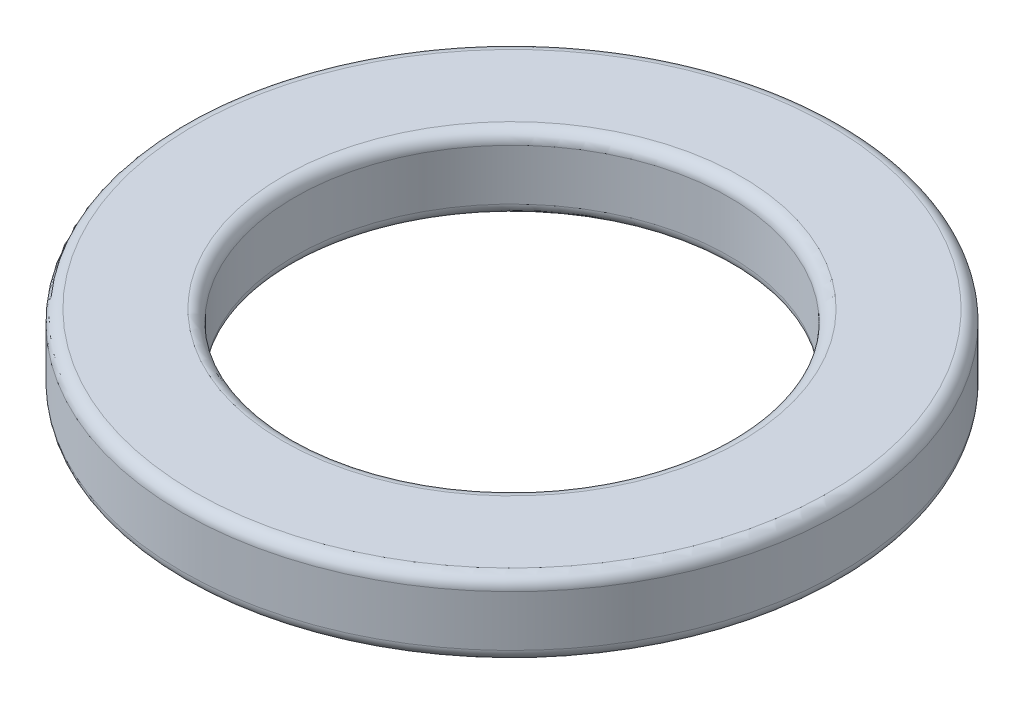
ISO-10303-21;
HEADER;
FILE_DESCRIPTION(('STEP AP214'),'2;1');
FILE_NAME('part.step','',(''),(''),'','','');
FILE_SCHEMA(('AUTOMOTIVE_DESIGN { 1 0 10303 214 1 1 1 1 }'));
ENDSEC;
DATA;
#1=APPLICATION_CONTEXT('core data for automotive mechanical design processes');
#2=APPLICATION_PROTOCOL_DEFINITION('international standard','automotive_design',2000,#1);
#3=PRODUCT_CONTEXT('',#1,'mechanical');
#4=PRODUCT('Part','Part','',(#3));
#5=PRODUCT_RELATED_PRODUCT_CATEGORY('part','',(#4));
#6=PRODUCT_DEFINITION_FORMATION('','',#4);
#7=PRODUCT_DEFINITION_CONTEXT('part definition',#1,'design');
#8=PRODUCT_DEFINITION('design','',#6,#7);
#9=PRODUCT_DEFINITION_SHAPE('','',#8);
#10=(LENGTH_UNIT() NAMED_UNIT(*) SI_UNIT(.MILLI.,.METRE.));
#11=(NAMED_UNIT(*) PLANE_ANGLE_UNIT() SI_UNIT($,.RADIAN.));
#12=(NAMED_UNIT(*) SI_UNIT($,.STERADIAN.) SOLID_ANGLE_UNIT());
#13=UNCERTAINTY_MEASURE_WITH_UNIT(LENGTH_MEASURE(1.E-05),#10,'distance_accuracy_value','');
#14=(GEOMETRIC_REPRESENTATION_CONTEXT(3) GLOBAL_UNCERTAINTY_ASSIGNED_CONTEXT((#13)) GLOBAL_UNIT_ASSIGNED_CONTEXT((#10,
#11,#12)) REPRESENTATION_CONTEXT('',''));
#15=CARTESIAN_POINT('',(0.,0.,0.));
#16=DIRECTION('',(0.,0.,1.));
#17=DIRECTION('',(1.,0.,0.));
#18=AXIS2_PLACEMENT_3D('',#15,#16,#17);
#19=CARTESIAN_POINT('',(0.,2.1,0.));
#20=DIRECTION('',(0.,1.,0.));
#21=DIRECTION('',(0.,0.,1.));
#22=AXIS2_PLACEMENT_3D('',#19,#20,#21);
#23=TOROIDAL_SURFACE('',#22,7.65,0.4);
#24=CARTESIAN_POINT('',(0.,2.1,0.));
#25=DIRECTION('',(0.,1.,0.));
#26=DIRECTION('',(0.,0.,1.));
#27=AXIS2_PLACEMENT_3D('',#24,#25,#26);
#28=CIRCLE('',#27,7.25);
#29=CARTESIAN_POINT('',(0.,2.1,7.25));
#30=VERTEX_POINT('',#29);
#31=EDGE_CURVE('E10',#30,#30,#28,.T.);
#32=ORIENTED_EDGE('',*,*,#31,.F.);
#33=EDGE_LOOP('',(#32));
#34=FACE_BOUND('',#33,.T.);
#35=CARTESIAN_POINT('',(0.,2.5,0.));
#36=DIRECTION('',(0.,1.,0.));
#37=DIRECTION('',(0.,0.,1.));
#38=AXIS2_PLACEMENT_3D('',#35,#36,#37);
#39=CIRCLE('',#38,7.65);
#40=CARTESIAN_POINT('',(0.,2.5,7.65));
#41=VERTEX_POINT('',#40);
#42=EDGE_CURVE('E57',#41,#41,#39,.T.);
#43=ORIENTED_EDGE('',*,*,#42,.T.);
#44=EDGE_LOOP('',(#43));
#45=FACE_BOUND('',#44,.T.);
#46=ADVANCED_FACE('F29',(#34,#45),#23,.T.);
#47=CARTESIAN_POINT('',(0.,15.7889265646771,0.));
#48=DIRECTION('',(0.,1.,0.));
#49=DIRECTION('',(0.,0.,1.));
#50=AXIS2_PLACEMENT_3D('',#47,#48,#49);
#51=CYLINDRICAL_SURFACE('',#50,7.25);
#52=CARTESIAN_POINT('',(0.,0.400000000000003,0.));
#53=DIRECTION('',(0.,1.,0.));
#54=DIRECTION('',(0.,0.,1.));
#55=AXIS2_PLACEMENT_3D('',#52,#53,#54);
#56=CIRCLE('',#55,7.25);
#57=CARTESIAN_POINT('',(0.,0.400000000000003,7.25));
#58=VERTEX_POINT('',#57);
#59=EDGE_CURVE('E35',#58,#58,#56,.T.);
#60=ORIENTED_EDGE('',*,*,#59,.F.);
#61=EDGE_LOOP('',(#60));
#62=FACE_BOUND('',#61,.T.);
#63=ORIENTED_EDGE('',*,*,#31,.T.);
#64=EDGE_LOOP('',(#63));
#65=FACE_BOUND('',#64,.T.);
#66=ADVANCED_FACE('F94',(#62,#65),#51,.F.);
#67=CARTESIAN_POINT('',(0.,0.399999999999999,0.));
#68=DIRECTION('',(0.,1.,0.));
#69=DIRECTION('',(0.,0.,1.));
#70=AXIS2_PLACEMENT_3D('',#67,#68,#69);
#71=TOROIDAL_SURFACE('',#70,7.65,0.4);
#72=CARTESIAN_POINT('',(0.,0.,0.));
#73=DIRECTION('',(0.,1.,0.));
#74=DIRECTION('',(0.,0.,1.));
#75=AXIS2_PLACEMENT_3D('',#72,#73,#74);
#76=CIRCLE('',#75,7.65);
#77=CARTESIAN_POINT('',(0.,0.,7.65));
#78=VERTEX_POINT('',#77);
#79=EDGE_CURVE('E39',#78,#78,#76,.T.);
#80=ORIENTED_EDGE('',*,*,#79,.F.);
#81=EDGE_LOOP('',(#80));
#82=FACE_BOUND('',#81,.T.);
#83=ORIENTED_EDGE('',*,*,#59,.T.);
#84=EDGE_LOOP('',(#83));
#85=FACE_BOUND('',#84,.T.);
#86=ADVANCED_FACE('F89',(#82,#85),#71,.T.);
#87=CARTESIAN_POINT('',(7.65,0.,0.));
#88=DIRECTION('',(0.,1.,0.));
#89=DIRECTION('',(0.,0.,1.));
#90=AXIS2_PLACEMENT_3D('',#87,#88,#89);
#91=PLANE('',#90);
#92=CARTESIAN_POINT('',(0.,0.,0.));
#93=DIRECTION('',(0.,1.,0.));
#94=DIRECTION('',(0.,0.,1.));
#95=AXIS2_PLACEMENT_3D('',#92,#93,#94);
#96=CIRCLE('',#95,10.6);
#97=CARTESIAN_POINT('',(0.,0.,10.6));
#98=VERTEX_POINT('',#97);
#99=EDGE_CURVE('E43',#98,#98,#96,.T.);
#100=ORIENTED_EDGE('',*,*,#99,.F.);
#101=EDGE_LOOP('',(#100));
#102=FACE_BOUND('',#101,.T.);
#103=ORIENTED_EDGE('',*,*,#79,.T.);
#104=EDGE_LOOP('',(#103));
#105=FACE_BOUND('',#104,.T.);
#106=ADVANCED_FACE('F83',(#102,#105),#91,.F.);
#107=CARTESIAN_POINT('',(0.,0.399999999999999,0.));
#108=DIRECTION('',(0.,1.,0.));
#109=DIRECTION('',(0.,0.,1.));
#110=AXIS2_PLACEMENT_3D('',#107,#108,#109);
#111=TOROIDAL_SURFACE('',#110,10.6,0.4);
#112=CARTESIAN_POINT('',(0.,0.400000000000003,0.));
#113=DIRECTION('',(0.,1.,0.));
#114=DIRECTION('',(0.,0.,1.));
#115=AXIS2_PLACEMENT_3D('',#112,#113,#114);
#116=CIRCLE('',#115,11.);
#117=CARTESIAN_POINT('',(0.,0.400000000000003,11.));
#118=VERTEX_POINT('',#117);
#119=EDGE_CURVE('E48',#118,#118,#116,.T.);
#120=ORIENTED_EDGE('',*,*,#119,.F.);
#121=EDGE_LOOP('',(#120));
#122=FACE_BOUND('',#121,.T.);
#123=ORIENTED_EDGE('',*,*,#99,.T.);
#124=EDGE_LOOP('',(#123));
#125=FACE_BOUND('',#124,.T.);
#126=ADVANCED_FACE('F77',(#122,#125),#111,.T.);
#127=CARTESIAN_POINT('',(0.,15.7889265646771,0.));
#128=DIRECTION('',(0.,1.,0.));
#129=DIRECTION('',(0.,0.,1.));
#130=AXIS2_PLACEMENT_3D('',#127,#128,#129);
#131=CYLINDRICAL_SURFACE('',#130,11.);
#132=CARTESIAN_POINT('',(0.,2.1,0.));
#133=DIRECTION('',(0.,1.,0.));
#134=DIRECTION('',(0.,0.,1.));
#135=AXIS2_PLACEMENT_3D('',#132,#133,#134);
#136=CIRCLE('',#135,11.);
#137=CARTESIAN_POINT('',(0.,2.1,11.));
#138=VERTEX_POINT('',#137);
#139=EDGE_CURVE('E51',#138,#138,#136,.T.);
#140=ORIENTED_EDGE('',*,*,#139,.F.);
#141=EDGE_LOOP('',(#140));
#142=FACE_BOUND('',#141,.T.);
#143=ORIENTED_EDGE('',*,*,#119,.T.);
#144=EDGE_LOOP('',(#143));
#145=FACE_BOUND('',#144,.T.);
#146=ADVANCED_FACE('F71',(#142,#145),#131,.T.);
#147=CARTESIAN_POINT('',(0.,2.1,0.));
#148=DIRECTION('',(0.,1.,0.));
#149=DIRECTION('',(0.,0.,1.));
#150=AXIS2_PLACEMENT_3D('',#147,#148,#149);
#151=TOROIDAL_SURFACE('',#150,10.6,0.4);
#152=CARTESIAN_POINT('',(0.,2.5,0.));
#153=DIRECTION('',(0.,1.,0.));
#154=DIRECTION('',(0.,0.,1.));
#155=AXIS2_PLACEMENT_3D('',#152,#153,#154);
#156=CIRCLE('',#155,10.6);
#157=CARTESIAN_POINT('',(0.,2.5,10.6));
#158=VERTEX_POINT('',#157);
#159=EDGE_CURVE('E54',#158,#158,#156,.T.);
#160=ORIENTED_EDGE('',*,*,#159,.F.);
#161=EDGE_LOOP('',(#160));
#162=FACE_BOUND('',#161,.T.);
#163=ORIENTED_EDGE('',*,*,#139,.T.);
#164=EDGE_LOOP('',(#163));
#165=FACE_BOUND('',#164,.T.);
#166=ADVANCED_FACE('F65',(#162,#165),#151,.T.);
#167=CARTESIAN_POINT('',(7.65,2.5,0.));
#168=DIRECTION('',(0.,-1.,0.));
#169=DIRECTION('',(0.,0.,-1.));
#170=AXIS2_PLACEMENT_3D('',#167,#168,#169);
#171=PLANE('',#170);
#172=ORIENTED_EDGE('',*,*,#42,.F.);
#173=EDGE_LOOP('',(#172));
#174=FACE_BOUND('',#173,.T.);
#175=ORIENTED_EDGE('',*,*,#159,.T.);
#176=EDGE_LOOP('',(#175));
#177=FACE_BOUND('',#176,.T.);
#178=ADVANCED_FACE('F62',(#174,#177),#171,.F.);
#179=CLOSED_SHELL('',(#46,#66,#86,#106,#126,#146,#166,#178));
#180=MANIFOLD_SOLID_BREP('B2',#179);
#181=ADVANCED_BREP_SHAPE_REPRESENTATION('',(#18,#180),#14);
#182=SHAPE_DEFINITION_REPRESENTATION(#9,#181);
ENDSEC;
END-ISO-10303-21;
